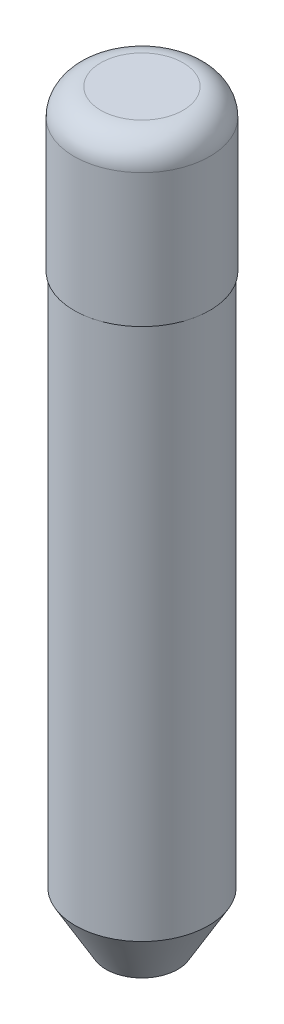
from build123d import *

# Parameters (mm, degrees)
FILLET1_R = 0.635


with BuildPart() as part:
    # Sketch1 → Revolve1 (revolve)
    with BuildSketch(Plane.XY, mode=Mode.PRIVATE) as revolve1_sk:
        Polygon((0, 8.89), (-1.61544, 8.89), (-1.61544, 5.08), (-1.5875, 5.08), (-1.5875, -7.62), (-0.854265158, -8.89), (0, -8.89), align=None)
    revolve(revolve1_sk.sketch.rotate(Axis((0, 39.006829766, 0), (0, -1, 0)), 270), axis=Axis((0, 39.006829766, 0), (0, -1, 0)))

    # Fillet1
    fillet1_edges = [part.edges().sort_by_distance(p)[0] for p in [
        (0, 8.89, -1.61544),
    ]]
    fillet(fillet1_edges, radius=FILLET1_R)


solid = part.part
